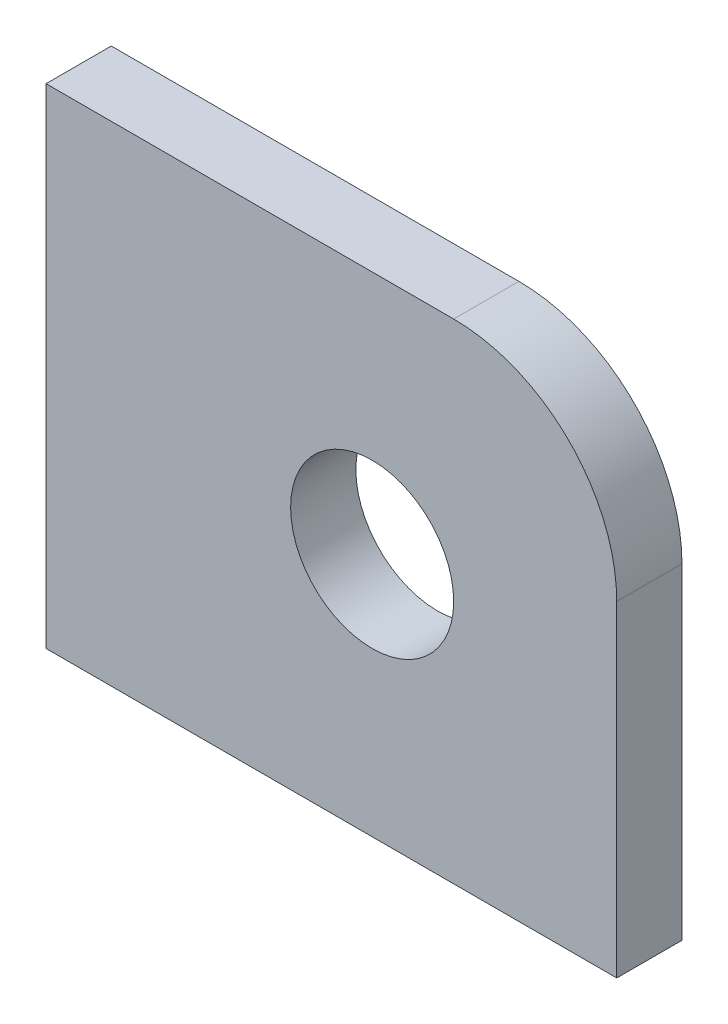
from build123d import *

# Parameters (mm, degrees)
ESQUISSE1_R          = 10
BASE_EXTRUSION_DEPTH = 8


with BuildPart() as part:
    # Esquisse1 → Base-Extrusion (new body)
    with BuildSketch(Plane.XY):
        with BuildLine():
            Line((0, 0), (70, 0))
            Line((70, 0), (70, 40))
            ThreePointArc((70, 40), (64.142135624, 54.142135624), (50, 60))
            Line((50, 60), (0, 60))
            Line((0, 60), (0, 0))
        make_face()
        with Locations((40, 30)):
            Circle(ESQUISSE1_R, mode=Mode.SUBTRACT)
    extrude(amount=BASE_EXTRUSION_DEPTH)


solid = part.part
